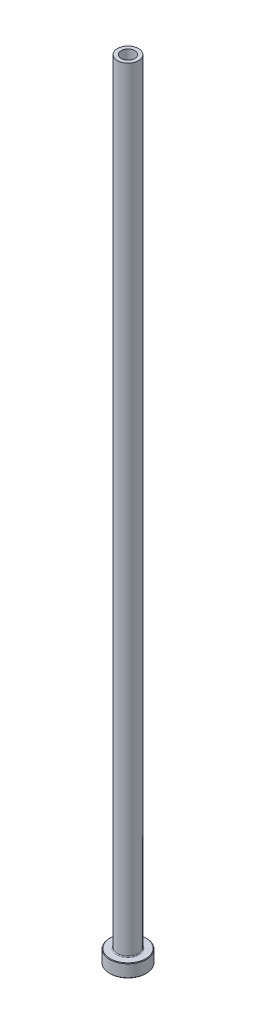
from build123d import *

# Parameters (mm, degrees)
FILLET1_R     = 0.3
CHAMFER1_SIZE = 0.2
CHAMFER3_SIZE = 0.5


with BuildPart() as part:
    # Sketch1 → Revolve1 (revolve)
    with BuildSketch(Plane.XY, mode=Mode.PRIVATE) as revolve1_sk:
        Polygon((-2.6, 300), (-4, 300), (-4, 5), (-7, 5), (-7, 0), (-2.85, 0), (-2.85, 243), (-2.6, 255), align=None)
    revolve(revolve1_sk.sketch.rotate(Axis((0, 92.187680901, 0), (0, -1, 0)), 270), axis=Axis((0, 92.187680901, 0), (0, -1, 0)))

    # Fillet1
    fillet1_edges = [part.edges().sort_by_distance(p)[0] for p in [
        (0, 5, -4),
    ]]
    fillet(fillet1_edges, radius=FILLET1_R)

    # Chamfer1
    chamfer1_edges = [part.edges().sort_by_distance(p)[0] for p in [
        (0, 0, -7),
        (0, 5, -7),
    ]]
    chamfer(chamfer1_edges, length=CHAMFER1_SIZE)

    # Chamfer3
    chamfer3_edges = [part.edges().sort_by_distance(p)[0] for p in [
        (0, 0, -2.85),
    ]]
    chamfer(chamfer3_edges, length=CHAMFER3_SIZE)


solid = part.part
